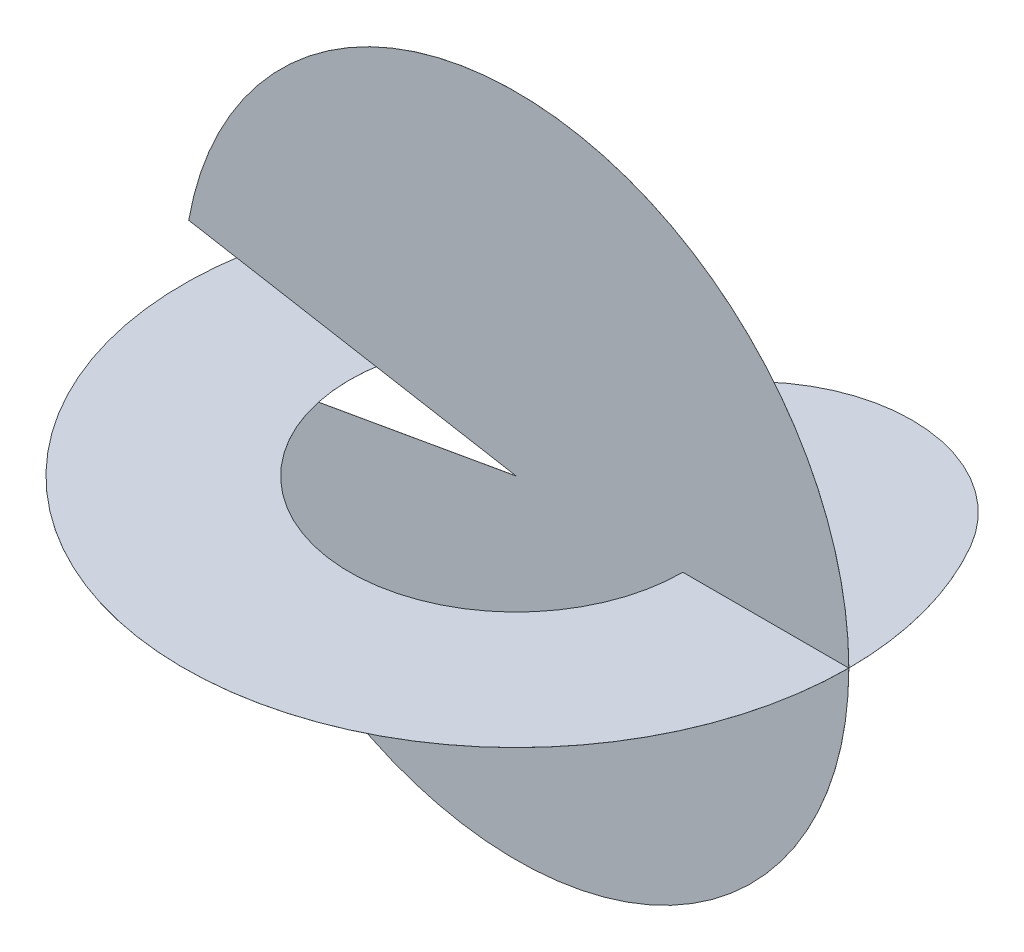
ISO-10303-21;
HEADER;
FILE_DESCRIPTION(('STEP AP214'),'2;1');
FILE_NAME('part.step','',(''),(''),'','','');
FILE_SCHEMA(('AUTOMOTIVE_DESIGN { 1 0 10303 214 1 1 1 1 }'));
ENDSEC;
DATA;
#1=APPLICATION_CONTEXT('core data for automotive mechanical design processes');
#2=APPLICATION_PROTOCOL_DEFINITION('international standard','automotive_design',2000,#1);
#3=PRODUCT_CONTEXT('',#1,'mechanical');
#4=PRODUCT('Part','Part','',(#3));
#5=PRODUCT_RELATED_PRODUCT_CATEGORY('part','',(#4));
#6=PRODUCT_DEFINITION_FORMATION('','',#4);
#7=PRODUCT_DEFINITION_CONTEXT('part definition',#1,'design');
#8=PRODUCT_DEFINITION('design','',#6,#7);
#9=PRODUCT_DEFINITION_SHAPE('','',#8);
#10=(LENGTH_UNIT() NAMED_UNIT(*) SI_UNIT(.MILLI.,.METRE.));
#11=(NAMED_UNIT(*) PLANE_ANGLE_UNIT() SI_UNIT($,.RADIAN.));
#12=(NAMED_UNIT(*) SI_UNIT($,.STERADIAN.) SOLID_ANGLE_UNIT());
#13=UNCERTAINTY_MEASURE_WITH_UNIT(LENGTH_MEASURE(1.E-05),#10,'distance_accuracy_value','');
#14=(GEOMETRIC_REPRESENTATION_CONTEXT(3) GLOBAL_UNCERTAINTY_ASSIGNED_CONTEXT((#13)) GLOBAL_UNIT_ASSIGNED_CONTEXT((#10,
#11,#12)) REPRESENTATION_CONTEXT('',''));
#15=CARTESIAN_POINT('',(0.,0.,0.));
#16=DIRECTION('',(0.,0.,1.));
#17=DIRECTION('',(1.,0.,0.));
#18=AXIS2_PLACEMENT_3D('',#15,#16,#17);
#19=CARTESIAN_POINT('',(0.,-0.1,341.5));
#20=DIRECTION('',(0.,1.,0.));
#21=DIRECTION('',(0.,0.,1.));
#22=AXIS2_PLACEMENT_3D('',#19,#20,#21);
#23=CYLINDRICAL_SURFACE('',#22,380.772898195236);
#24=DIRECTION('',(0.,1.,0.));
#25=VECTOR('',#24,1.);
#26=CARTESIAN_POINT('',(380.772898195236,-0.1,341.5));
#27=LINE('',#26,#25);
#28=CARTESIAN_POINT('',(380.772898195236,0.,341.5));
#29=VERTEX_POINT('',#28);
#30=CARTESIAN_POINT('',(380.772898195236,-0.1,341.5));
#31=VERTEX_POINT('',#30);
#32=EDGE_CURVE('E149',#29,#31,#27,.F.);
#33=ORIENTED_EDGE('',*,*,#32,.F.);
#34=CARTESIAN_POINT('',(0.,0.,341.5));
#35=DIRECTION('',(0.,1.,0.));
#36=DIRECTION('',(1.,0.,0.));
#37=AXIS2_PLACEMENT_3D('',#34,#35,#36);
#38=CIRCLE('',#37,380.772898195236);
#39=CARTESIAN_POINT('',(24.2487113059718,0.,-38.4999999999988));
#40=VERTEX_POINT('',#39);
#41=EDGE_CURVE('E184',#29,#40,#38,.T.);
#42=ORIENTED_EDGE('',*,*,#41,.T.);
#43=DIRECTION('',(0.,1.,0.));
#44=VECTOR('',#43,1.);
#45=CARTESIAN_POINT('',(24.2487113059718,-0.1,-38.4999999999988));
#46=LINE('',#45,#44);
#47=CARTESIAN_POINT('',(24.2487113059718,-0.1,-38.4999999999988));
#48=VERTEX_POINT('',#47);
#49=EDGE_CURVE('E201',#48,#40,#46,.T.);
#50=ORIENTED_EDGE('',*,*,#49,.F.);
#51=CARTESIAN_POINT('',(0.,-0.1,341.5));
#52=DIRECTION('',(0.,1.,0.));
#53=DIRECTION('',(1.,0.,0.));
#54=AXIS2_PLACEMENT_3D('',#51,#52,#53);
#55=CIRCLE('',#54,380.772898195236);
#56=EDGE_CURVE('E168',#31,#48,#55,.T.);
#57=ORIENTED_EDGE('',*,*,#56,.F.);
#58=EDGE_LOOP('',(#33,#42,#50,#57));
#59=FACE_BOUND('',#58,.T.);
#60=ADVANCED_FACE('F16',(#59),#23,.F.);
#61=CARTESIAN_POINT('',(-170.607004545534,-0.1,243.));
#62=DIRECTION('',(0.,-1.,0.));
#63=DIRECTION('',(0.,0.,-1.));
#64=AXIS2_PLACEMENT_3D('',#61,#62,#63);
#65=PLANE('',#64);
#66=CARTESIAN_POINT('',(0.,-0.1,341.5));
#67=DIRECTION('',(0.,-1.,0.));
#68=DIRECTION('',(1.,0.,0.));
#69=AXIS2_PLACEMENT_3D('',#66,#67,#68);
#70=CIRCLE('',#69,760.);
#71=CARTESIAN_POINT('',(658.179306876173,-0.1,-38.5000000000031));
#72=VERTEX_POINT('',#71);
#73=CARTESIAN_POINT('',(760.,-0.1,341.5));
#74=VERTEX_POINT('',#73);
#75=EDGE_CURVE('E177',#72,#74,#70,.T.);
#76=ORIENTED_EDGE('',*,*,#75,.T.);
#77=DIRECTION('',(-1.,0.,0.));
#78=VECTOR('',#77,1.);
#79=CARTESIAN_POINT('',(-170.607004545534,-0.1,341.5));
#80=LINE('',#79,#78);
#81=EDGE_CURVE('E154',#74,#31,#80,.T.);
#82=ORIENTED_EDGE('',*,*,#81,.T.);
#83=ORIENTED_EDGE('',*,*,#56,.T.);
#84=CARTESIAN_POINT('',(341.214009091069,-0.1,144.499999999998));
#85=DIRECTION('',(0.,-1.,0.));
#86=DIRECTION('',(1.,0.,0.));
#87=AXIS2_PLACEMENT_3D('',#84,#85,#86);
#88=CIRCLE('',#87,366.);
#89=EDGE_CURVE('E173',#48,#72,#88,.T.);
#90=ORIENTED_EDGE('',*,*,#89,.T.);
#91=EDGE_LOOP('',(#76,#82,#83,#90));
#92=FACE_BOUND('',#91,.T.);
#93=ADVANCED_FACE('F270',(#92),#65,.T.);
#94=CARTESIAN_POINT('',(-170.607004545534,0.,243.));
#95=DIRECTION('',(0.,-1.,0.));
#96=DIRECTION('',(0.,0.,-1.));
#97=AXIS2_PLACEMENT_3D('',#94,#95,#96);
#98=PLANE('',#97);
#99=DIRECTION('',(-1.,0.,0.));
#100=VECTOR('',#99,1.);
#101=CARTESIAN_POINT('',(-170.607004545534,0.,341.5));
#102=LINE('',#101,#100);
#103=CARTESIAN_POINT('',(760.,0.,341.5));
#104=VERTEX_POINT('',#103);
#105=EDGE_CURVE('E25',#104,#29,#102,.T.);
#106=ORIENTED_EDGE('',*,*,#105,.F.);
#107=CARTESIAN_POINT('',(0.,0.,341.5));
#108=DIRECTION('',(0.,-1.,0.));
#109=DIRECTION('',(1.,0.,0.));
#110=AXIS2_PLACEMENT_3D('',#107,#108,#109);
#111=CIRCLE('',#110,760.);
#112=CARTESIAN_POINT('',(658.179306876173,0.,-38.5000000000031));
#113=VERTEX_POINT('',#112);
#114=EDGE_CURVE('E169',#113,#104,#111,.T.);
#115=ORIENTED_EDGE('',*,*,#114,.F.);
#116=CARTESIAN_POINT('',(341.214009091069,0.,144.499999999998));
#117=DIRECTION('',(0.,-1.,0.));
#118=DIRECTION('',(1.,0.,0.));
#119=AXIS2_PLACEMENT_3D('',#116,#117,#118);
#120=CIRCLE('',#119,366.);
#121=EDGE_CURVE('E189',#40,#113,#120,.T.);
#122=ORIENTED_EDGE('',*,*,#121,.F.);
#123=ORIENTED_EDGE('',*,*,#41,.F.);
#124=EDGE_LOOP('',(#106,#115,#122,#123));
#125=FACE_BOUND('',#124,.T.);
#126=ADVANCED_FACE('F223',(#125),#98,.F.);
#127=CARTESIAN_POINT('',(-341.214009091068,-0.1,144.5));
#128=DIRECTION('',(0.,1.,0.));
#129=DIRECTION('',(0.,0.,1.));
#130=AXIS2_PLACEMENT_3D('',#127,#128,#129);
#131=CYLINDRICAL_SURFACE('',#130,366.);
#132=CARTESIAN_POINT('',(-341.214009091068,0.,144.5));
#133=DIRECTION('',(0.,-1.,0.));
#134=DIRECTION('',(1.,0.,0.));
#135=AXIS2_PLACEMENT_3D('',#132,#133,#134);
#136=CIRCLE('',#135,366.);
#137=CARTESIAN_POINT('',(-658.179306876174,0.,-38.4999999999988));
#138=VERTEX_POINT('',#137);
#139=CARTESIAN_POINT('',(-24.2487113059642,0.,-38.5));
#140=VERTEX_POINT('',#139);
#141=EDGE_CURVE('E163',#138,#140,#136,.T.);
#142=ORIENTED_EDGE('',*,*,#141,.T.);
#143=DIRECTION('',(0.,1.,0.));
#144=VECTOR('',#143,1.);
#145=CARTESIAN_POINT('',(-24.2487113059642,-0.1,-38.5));
#146=LINE('',#145,#144);
#147=CARTESIAN_POINT('',(-24.2487113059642,-0.1,-38.5));
#148=VERTEX_POINT('',#147);
#149=EDGE_CURVE('E205',#148,#140,#146,.T.);
#150=ORIENTED_EDGE('',*,*,#149,.F.);
#151=CARTESIAN_POINT('',(-341.214009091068,-0.1,144.5));
#152=DIRECTION('',(0.,-1.,0.));
#153=DIRECTION('',(1.,0.,0.));
#154=AXIS2_PLACEMENT_3D('',#151,#152,#153);
#155=CIRCLE('',#154,366.);
#156=CARTESIAN_POINT('',(-658.179306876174,-0.1,-38.4999999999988));
#157=VERTEX_POINT('',#156);
#158=EDGE_CURVE('E164',#157,#148,#155,.T.);
#159=ORIENTED_EDGE('',*,*,#158,.F.);
#160=DIRECTION('',(0.,1.,0.));
#161=VECTOR('',#160,1.);
#162=CARTESIAN_POINT('',(-658.179306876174,-0.1,-38.4999999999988));
#163=LINE('',#162,#161);
#164=EDGE_CURVE('E180',#157,#138,#163,.T.);
#165=ORIENTED_EDGE('',*,*,#164,.T.);
#166=EDGE_LOOP('',(#142,#150,#159,#165));
#167=FACE_BOUND('',#166,.T.);
#168=ADVANCED_FACE('F18',(#167),#131,.T.);
#169=CARTESIAN_POINT('',(380.772885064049,0.,341.6));
#170=VERTEX_POINT('',#169);
#171=EDGE_CURVE('E185',#140,#170,#38,.T.);
#172=ORIENTED_EDGE('',*,*,#171,.T.);
#173=DIRECTION('',(0.,1.,0.));
#174=VECTOR('',#173,1.);
#175=CARTESIAN_POINT('',(380.772885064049,-0.1,341.6));
#176=LINE('',#175,#174);
#177=CARTESIAN_POINT('',(380.772885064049,-0.1,341.6));
#178=VERTEX_POINT('',#177);
#179=EDGE_CURVE('E157',#170,#178,#176,.F.);
#180=ORIENTED_EDGE('',*,*,#179,.T.);
#181=EDGE_CURVE('E170',#148,#178,#55,.T.);
#182=ORIENTED_EDGE('',*,*,#181,.F.);
#183=ORIENTED_EDGE('',*,*,#149,.T.);
#184=EDGE_LOOP('',(#172,#180,#182,#183));
#185=FACE_BOUND('',#184,.T.);
#186=ADVANCED_FACE('F246',(#185),#23,.F.);
#187=CARTESIAN_POINT('',(341.214009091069,-0.1,144.499999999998));
#188=DIRECTION('',(0.,1.,0.));
#189=DIRECTION('',(0.,0.,1.));
#190=AXIS2_PLACEMENT_3D('',#187,#188,#189);
#191=CYLINDRICAL_SURFACE('',#190,366.);
#192=ORIENTED_EDGE('',*,*,#121,.T.);
#193=DIRECTION('',(0.,1.,0.));
#194=VECTOR('',#193,1.);
#195=CARTESIAN_POINT('',(658.179306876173,-0.1,-38.5000000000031));
#196=LINE('',#195,#194);
#197=EDGE_CURVE('E197',#72,#113,#196,.T.);
#198=ORIENTED_EDGE('',*,*,#197,.F.);
#199=ORIENTED_EDGE('',*,*,#89,.F.);
#200=ORIENTED_EDGE('',*,*,#49,.T.);
#201=EDGE_LOOP('',(#192,#198,#199,#200));
#202=FACE_BOUND('',#201,.T.);
#203=ADVANCED_FACE('F268',(#202),#191,.T.);
#204=CARTESIAN_POINT('',(0.,-0.1,341.5));
#205=DIRECTION('',(0.,1.,0.));
#206=DIRECTION('',(0.,0.,1.));
#207=AXIS2_PLACEMENT_3D('',#204,#205,#206);
#208=CYLINDRICAL_SURFACE('',#207,760.);
#209=CARTESIAN_POINT('',(759.999993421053,-0.1,341.6));
#210=VERTEX_POINT('',#209);
#211=EDGE_CURVE('E176',#210,#157,#70,.T.);
#212=ORIENTED_EDGE('',*,*,#211,.F.);
#213=DIRECTION('',(0.,0.,-1.));
#214=VECTOR('',#213,1.);
#215=CARTESIAN_POINT('',(759.999993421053,-0.1,341.6));
#216=LINE('',#215,#214);
#217=EDGE_CURVE('E39',#210,#74,#216,.T.);
#218=ORIENTED_EDGE('',*,*,#217,.T.);
#219=ORIENTED_EDGE('',*,*,#75,.F.);
#220=ORIENTED_EDGE('',*,*,#197,.T.);
#221=ORIENTED_EDGE('',*,*,#114,.T.);
#222=CARTESIAN_POINT('',(759.999993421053,0.,341.6));
#223=VERTEX_POINT('',#222);
#224=EDGE_CURVE('E196',#104,#223,#111,.T.);
#225=ORIENTED_EDGE('',*,*,#224,.T.);
#226=EDGE_CURVE('E192',#223,#138,#111,.T.);
#227=ORIENTED_EDGE('',*,*,#226,.T.);
#228=ORIENTED_EDGE('',*,*,#164,.F.);
#229=EDGE_LOOP('',(#212,#218,#219,#220,#221,#225,#227,#228));
#230=FACE_BOUND('',#229,.T.);
#231=ADVANCED_FACE('F227',(#230),#208,.T.);
#232=DIRECTION('',(-1.,0.,0.));
#233=VECTOR('',#232,1.);
#234=CARTESIAN_POINT('',(-170.607004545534,-0.1,341.6));
#235=LINE('',#234,#233);
#236=EDGE_CURVE('E32',#210,#178,#235,.T.);
#237=ORIENTED_EDGE('',*,*,#236,.F.);
#238=ORIENTED_EDGE('',*,*,#211,.T.);
#239=ORIENTED_EDGE('',*,*,#158,.T.);
#240=ORIENTED_EDGE('',*,*,#181,.T.);
#241=EDGE_LOOP('',(#237,#238,#239,#240));
#242=FACE_BOUND('',#241,.T.);
#243=ADVANCED_FACE('F247',(#242),#65,.T.);
#244=ORIENTED_EDGE('',*,*,#226,.F.);
#245=DIRECTION('',(-1.,0.,0.));
#246=VECTOR('',#245,1.);
#247=CARTESIAN_POINT('',(-170.607004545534,0.,341.6));
#248=LINE('',#247,#246);
#249=EDGE_CURVE('E11',#223,#170,#248,.T.);
#250=ORIENTED_EDGE('',*,*,#249,.T.);
#251=ORIENTED_EDGE('',*,*,#171,.F.);
#252=ORIENTED_EDGE('',*,*,#141,.F.);
#253=EDGE_LOOP('',(#244,#250,#251,#252));
#254=FACE_BOUND('',#253,.T.);
#255=ADVANCED_FACE('F243',(#254),#98,.F.);
#256=CARTESIAN_POINT('',(0.,0.,341.6));
#257=DIRECTION('',(0.,0.,-1.));
#258=DIRECTION('',(-1.,0.,0.));
#259=AXIS2_PLACEMENT_3D('',#256,#257,#258);
#260=CYLINDRICAL_SURFACE('',#259,760.);
#261=CARTESIAN_POINT('',(0.,0.,341.6));
#262=DIRECTION('',(0.,0.,1.));
#263=DIRECTION('',(1.,0.,0.));
#264=AXIS2_PLACEMENT_3D('',#261,#262,#263);
#265=CIRCLE('',#264,760.);
#266=CARTESIAN_POINT('',(-748.453892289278,131.972615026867,341.6));
#267=VERTEX_POINT('',#266);
#268=EDGE_CURVE('E126',#223,#267,#265,.T.);
#269=ORIENTED_EDGE('',*,*,#268,.F.);
#270=ORIENTED_EDGE('',*,*,#224,.F.);
#271=CARTESIAN_POINT('',(0.,0.,341.5));
#272=DIRECTION('',(0.,0.,1.));
#273=DIRECTION('',(1.,0.,0.));
#274=AXIS2_PLACEMENT_3D('',#271,#272,#273);
#275=CIRCLE('',#274,760.);
#276=CARTESIAN_POINT('',(-748.453892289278,131.972615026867,341.5));
#277=VERTEX_POINT('',#276);
#278=EDGE_CURVE('E140',#104,#277,#275,.T.);
#279=ORIENTED_EDGE('',*,*,#278,.T.);
#280=DIRECTION('',(0.,0.,-1.));
#281=VECTOR('',#280,1.);
#282=CARTESIAN_POINT('',(-748.453892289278,131.972615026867,341.6));
#283=LINE('',#282,#281);
#284=EDGE_CURVE('E146',#267,#277,#283,.T.);
#285=ORIENTED_EDGE('',*,*,#284,.F.);
#286=EDGE_LOOP('',(#269,#270,#279,#285));
#287=FACE_BOUND('',#286,.T.);
#288=ADVANCED_FACE('F232',(#287),#260,.T.);
#289=ORIENTED_EDGE('',*,*,#217,.F.);
#290=CARTESIAN_POINT('',(-748.453892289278,-131.972615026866,341.6));
#291=VERTEX_POINT('',#290);
#292=EDGE_CURVE('E105',#291,#210,#265,.T.);
#293=ORIENTED_EDGE('',*,*,#292,.F.);
#294=DIRECTION('',(0.,0.,-1.));
#295=VECTOR('',#294,1.);
#296=CARTESIAN_POINT('',(-748.453892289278,-131.972615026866,341.6));
#297=LINE('',#296,#295);
#298=CARTESIAN_POINT('',(-748.453892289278,-131.972615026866,341.5));
#299=VERTEX_POINT('',#298);
#300=EDGE_CURVE('E112',#291,#299,#297,.T.);
#301=ORIENTED_EDGE('',*,*,#300,.T.);
#302=EDGE_CURVE('E136',#299,#74,#275,.T.);
#303=ORIENTED_EDGE('',*,*,#302,.T.);
#304=EDGE_LOOP('',(#289,#293,#301,#303));
#305=FACE_BOUND('',#304,.T.);
#306=ADVANCED_FACE('F124',(#305),#260,.T.);
#307=CARTESIAN_POINT('',(-748.453892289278,131.972615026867,341.6));
#308=DIRECTION('',(0.17364817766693,0.984807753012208,0.));
#309=DIRECTION('',(-0.984807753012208,0.17364817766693,0.));
#310=AXIS2_PLACEMENT_3D('',#307,#308,#309);
#311=PLANE('',#310);
#312=DIRECTION('',(0.984807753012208,-0.17364817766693,0.));
#313=VECTOR('',#312,1.);
#314=CARTESIAN_POINT('',(-748.453892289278,131.972615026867,341.5));
#315=LINE('',#314,#313);
#316=CARTESIAN_POINT('',(0.,0.,341.5));
#317=VERTEX_POINT('',#316);
#318=EDGE_CURVE('E139',#277,#317,#315,.T.);
#319=ORIENTED_EDGE('',*,*,#318,.T.);
#320=DIRECTION('',(0.,0.,-1.));
#321=VECTOR('',#320,1.);
#322=CARTESIAN_POINT('',(0.,0.,341.6));
#323=LINE('',#322,#321);
#324=CARTESIAN_POINT('',(0.,0.,341.6));
#325=VERTEX_POINT('',#324);
#326=EDGE_CURVE('E122',#325,#317,#323,.T.);
#327=ORIENTED_EDGE('',*,*,#326,.F.);
#328=DIRECTION('',(0.984807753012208,-0.17364817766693,0.));
#329=VECTOR('',#328,1.);
#330=CARTESIAN_POINT('',(-748.453892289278,131.972615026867,341.6));
#331=LINE('',#330,#329);
#332=EDGE_CURVE('E107',#267,#325,#331,.T.);
#333=ORIENTED_EDGE('',*,*,#332,.F.);
#334=ORIENTED_EDGE('',*,*,#284,.T.);
#335=EDGE_LOOP('',(#319,#327,#333,#334));
#336=FACE_BOUND('',#335,.T.);
#337=ADVANCED_FACE('F272',(#336),#311,.F.);
#338=CARTESIAN_POINT('',(0.,0.,341.6));
#339=DIRECTION('',(0.17364817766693,-0.984807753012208,0.));
#340=DIRECTION('',(0.984807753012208,0.17364817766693,0.));
#341=AXIS2_PLACEMENT_3D('',#338,#339,#340);
#342=PLANE('',#341);
#343=DIRECTION('',(-0.984807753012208,-0.17364817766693,0.));
#344=VECTOR('',#343,1.);
#345=CARTESIAN_POINT('',(0.,0.,341.5));
#346=LINE('',#345,#344);
#347=EDGE_CURVE('E117',#317,#299,#346,.T.);
#348=ORIENTED_EDGE('',*,*,#347,.T.);
#349=ORIENTED_EDGE('',*,*,#300,.F.);
#350=DIRECTION('',(-0.984807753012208,-0.17364817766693,0.));
#351=VECTOR('',#350,1.);
#352=CARTESIAN_POINT('',(0.,0.,341.6));
#353=LINE('',#352,#351);
#354=EDGE_CURVE('E101',#325,#291,#353,.T.);
#355=ORIENTED_EDGE('',*,*,#354,.F.);
#356=ORIENTED_EDGE('',*,*,#326,.T.);
#357=EDGE_LOOP('',(#348,#349,#355,#356));
#358=FACE_BOUND('',#357,.T.);
#359=ADVANCED_FACE('F115',(#358),#342,.F.);
#360=CARTESIAN_POINT('',(0.,0.,341.6));
#361=DIRECTION('',(0.,0.,1.));
#362=DIRECTION('',(1.,0.,0.));
#363=AXIS2_PLACEMENT_3D('',#360,#361,#362);
#364=PLANE('',#363);
#365=ORIENTED_EDGE('',*,*,#292,.T.);
#366=ORIENTED_EDGE('',*,*,#236,.T.);
#367=ORIENTED_EDGE('',*,*,#179,.F.);
#368=ORIENTED_EDGE('',*,*,#249,.F.);
#369=ORIENTED_EDGE('',*,*,#268,.T.);
#370=ORIENTED_EDGE('',*,*,#332,.T.);
#371=ORIENTED_EDGE('',*,*,#354,.T.);
#372=EDGE_LOOP('',(#365,#366,#367,#368,#369,#370,#371));
#373=FACE_BOUND('',#372,.T.);
#374=ADVANCED_FACE('F103',(#373),#364,.T.);
#375=CARTESIAN_POINT('',(0.,0.,341.5));
#376=DIRECTION('',(0.,0.,1.));
#377=DIRECTION('',(1.,0.,0.));
#378=AXIS2_PLACEMENT_3D('',#375,#376,#377);
#379=PLANE('',#378);
#380=ORIENTED_EDGE('',*,*,#81,.F.);
#381=ORIENTED_EDGE('',*,*,#302,.F.);
#382=ORIENTED_EDGE('',*,*,#347,.F.);
#383=ORIENTED_EDGE('',*,*,#318,.F.);
#384=ORIENTED_EDGE('',*,*,#278,.F.);
#385=ORIENTED_EDGE('',*,*,#105,.T.);
#386=ORIENTED_EDGE('',*,*,#32,.T.);
#387=EDGE_LOOP('',(#380,#381,#382,#383,#384,#385,#386));
#388=FACE_BOUND('',#387,.T.);
#389=ADVANCED_FACE('F218',(#388),#379,.F.);
#390=CLOSED_SHELL('',(#60,#93,#126,#168,#186,#203,#231,#243,#255,#288,#306,#337,#359,#374,#389));
#391=MANIFOLD_SOLID_BREP('B1',#390);
#392=ADVANCED_BREP_SHAPE_REPRESENTATION('',(#18,#391),#14);
#393=SHAPE_DEFINITION_REPRESENTATION(#9,#392);
ENDSEC;
END-ISO-10303-21;
